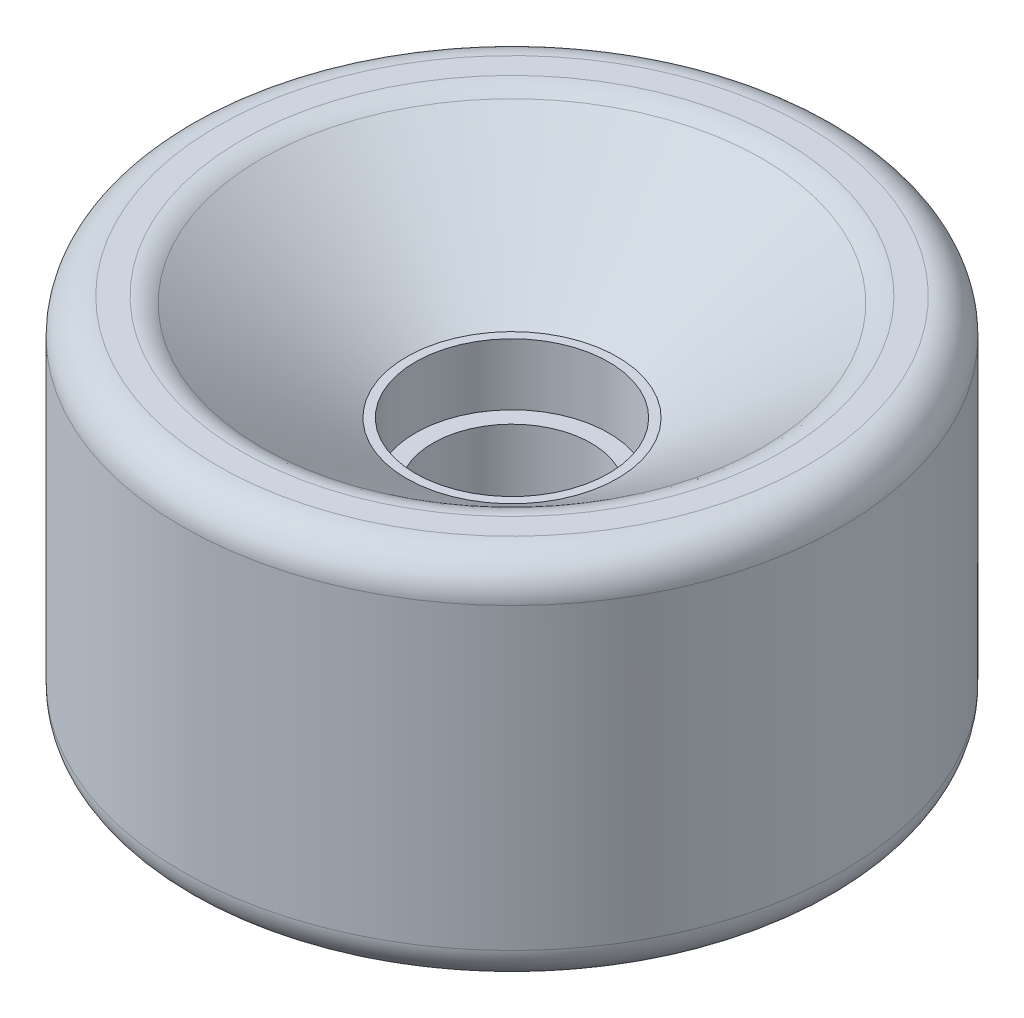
from build123d import *

# Parameters (mm, degrees)
FILLET1_R = 4


with BuildPart() as part:
    # Sketch1 → Revolve1 (revolve)
    with BuildSketch(Plane.XY, mode=Mode.PRIVATE) as revolve1_sk:
        Polygon((9, 2), (9, -8), (11, -8), (11, -15), (12, -15), (29.5, -21), (37.5, -21), (37.5, 21), (29.5, 21), (12, 9), (11, 9), (11, 2), align=None)
    revolve(revolve1_sk.sketch.rotate(Axis((0, 21, 0), (0, -1, 0)), 90), axis=Axis((0, 21, 0), (0, -1, 0)))

    # Fillet1
    fillet1_edges = [part.edges().sort_by_distance(p)[0] for p in [
        (0, 21, -37.5),
        (0, -21, -37.5),
        (0, -21, -29.5),
        (0, 21, -29.5),
    ]]
    fillet(fillet1_edges, radius=FILLET1_R)


solid = part.part
